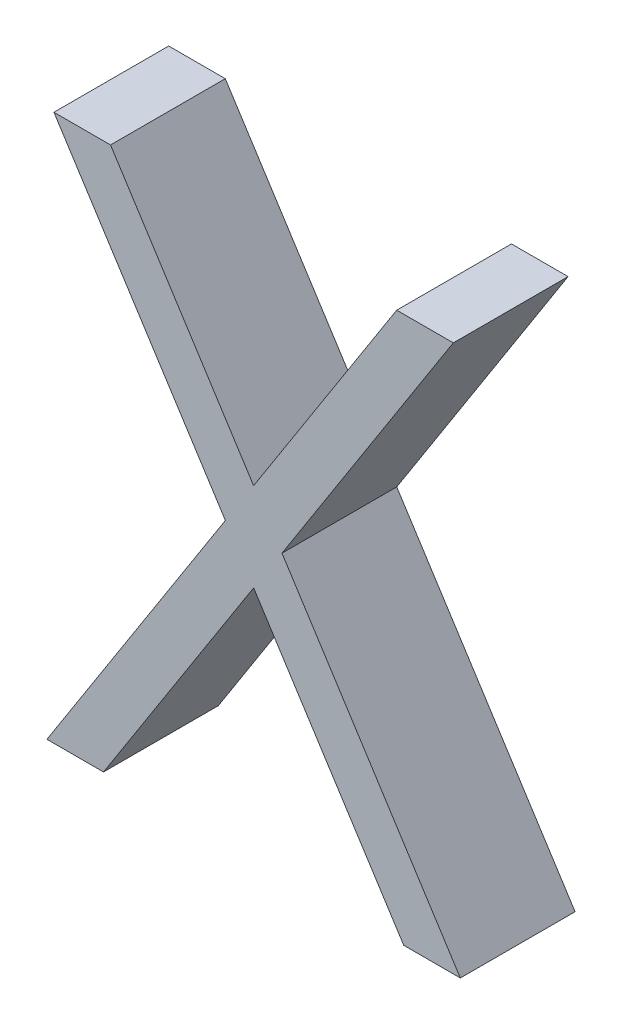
from build123d import *

# Parameters (mm, degrees)
BOSS_EXTRU_1_DEPTH = 2


with BuildPart() as part:
    # Esquisse1 → Boss.-Extru.1 (new, symmetric)
    with BuildSketch(Plane.XY):
        Polygon((144.609332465, 31.205317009), (146.582259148, 31.205317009), (151.569909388, 23.412829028), (156.557559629, 31.205317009), (158.530486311, 31.205317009), (152.558280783, 21.871122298), (158.774717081, 12.155317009), (156.801790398, 12.155317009), (151.569909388, 20.329415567), (146.338028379, 12.155317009), (144.365101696, 12.155317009), (150.5853541, 21.871122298), align=None)
    extrude(amount=BOSS_EXTRU_1_DEPTH, both=True)


solid = part.part
